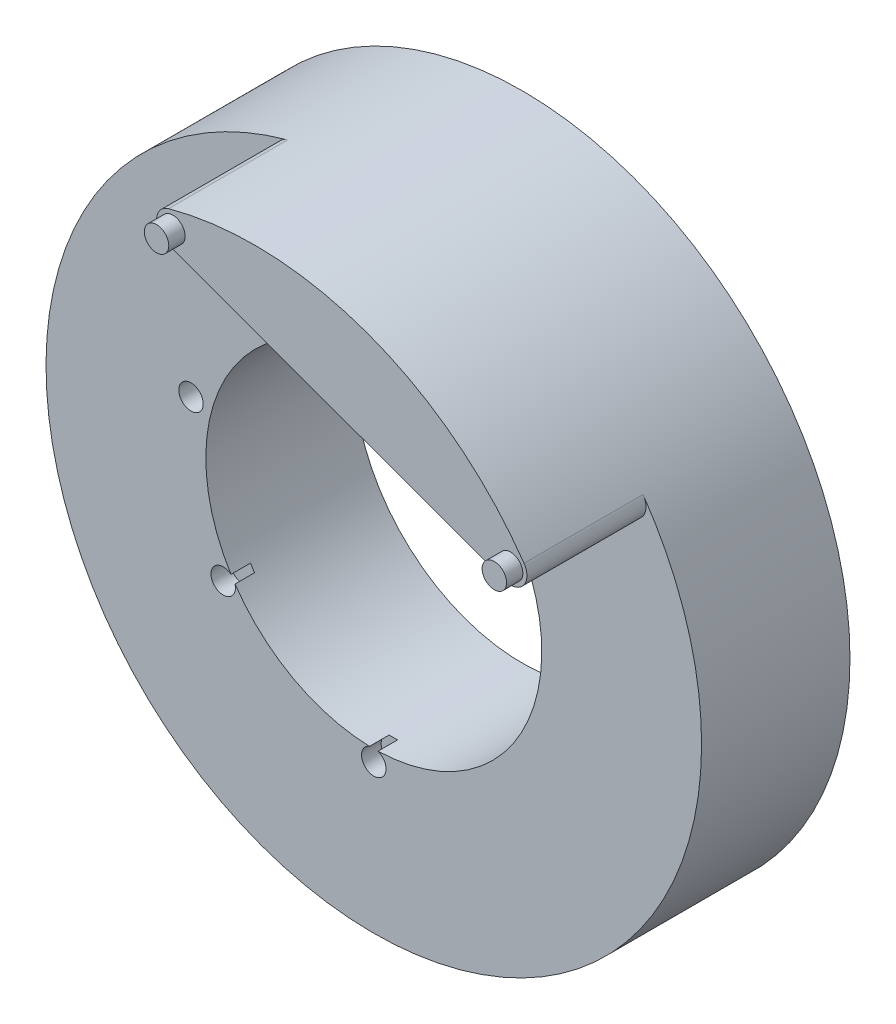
ISO-10303-21;
HEADER;
FILE_DESCRIPTION(('STEP AP214'),'2;1');
FILE_NAME('part.step','',(''),(''),'','','');
FILE_SCHEMA(('AUTOMOTIVE_DESIGN { 1 0 10303 214 1 1 1 1 }'));
ENDSEC;
DATA;
#1=APPLICATION_CONTEXT('core data for automotive mechanical design processes');
#2=APPLICATION_PROTOCOL_DEFINITION('international standard','automotive_design',2000,#1);
#3=PRODUCT_CONTEXT('',#1,'mechanical');
#4=PRODUCT('Part','Part','',(#3));
#5=PRODUCT_RELATED_PRODUCT_CATEGORY('part','',(#4));
#6=PRODUCT_DEFINITION_FORMATION('','',#4);
#7=PRODUCT_DEFINITION_CONTEXT('part definition',#1,'design');
#8=PRODUCT_DEFINITION('design','',#6,#7);
#9=PRODUCT_DEFINITION_SHAPE('','',#8);
#10=(LENGTH_UNIT() NAMED_UNIT(*) SI_UNIT(.MILLI.,.METRE.));
#11=(NAMED_UNIT(*) PLANE_ANGLE_UNIT() SI_UNIT($,.RADIAN.));
#12=(NAMED_UNIT(*) SI_UNIT($,.STERADIAN.) SOLID_ANGLE_UNIT());
#13=UNCERTAINTY_MEASURE_WITH_UNIT(LENGTH_MEASURE(1.E-05),#10,'distance_accuracy_value','');
#14=(GEOMETRIC_REPRESENTATION_CONTEXT(3) GLOBAL_UNCERTAINTY_ASSIGNED_CONTEXT((#13)) GLOBAL_UNIT_ASSIGNED_CONTEXT((#10,
#11,#12)) REPRESENTATION_CONTEXT('',''));
#15=CARTESIAN_POINT('',(0.,0.,0.));
#16=DIRECTION('',(0.,0.,1.));
#17=DIRECTION('',(1.,0.,0.));
#18=AXIS2_PLACEMENT_3D('',#15,#16,#17);
#19=CARTESIAN_POINT('',(4.36835391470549E-13,11.,66.7513852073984));
#20=DIRECTION('',(0.,0.,-1.));
#21=DIRECTION('',(-1.,0.,0.));
#22=AXIS2_PLACEMENT_3D('',#19,#20,#21);
#23=CYLINDRICAL_SURFACE('',#22,20.1);
#24=CARTESIAN_POINT('',(4.36835391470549E-13,11.,0.));
#25=DIRECTION('',(0.,0.,1.));
#26=DIRECTION('',(1.,0.,0.));
#27=AXIS2_PLACEMENT_3D('',#24,#25,#26);
#28=CIRCLE('',#27,20.1);
#29=CARTESIAN_POINT('',(20.1000000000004,11.,0.));
#30=VERTEX_POINT('',#29);
#31=EDGE_CURVE('E145',#30,#30,#28,.T.);
#32=ORIENTED_EDGE('',*,*,#31,.T.);
#33=EDGE_LOOP('',(#32));
#34=FACE_BOUND('',#33,.T.);
#35=CARTESIAN_POINT('',(4.36835391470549E-13,11.,16.4));
#36=DIRECTION('',(0.,0.,1.));
#37=DIRECTION('',(1.,0.,0.));
#38=AXIS2_PLACEMENT_3D('',#35,#36,#37);
#39=CIRCLE('',#38,20.1);
#40=CARTESIAN_POINT('',(16.5128721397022,22.4601506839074,16.4));
#41=VERTEX_POINT('',#40);
#42=CARTESIAN_POINT('',(-5.28315107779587,30.3932543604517,16.4));
#43=VERTEX_POINT('',#42);
#44=EDGE_CURVE('E144',#41,#43,#39,.T.);
#45=ORIENTED_EDGE('',*,*,#44,.F.);
#46=DIRECTION('',(0.,0.,-1.));
#47=VECTOR('',#46,1.);
#48=CARTESIAN_POINT('',(16.5128721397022,22.4601506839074,66.7513852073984));
#49=LINE('',#48,#47);
#50=CARTESIAN_POINT('',(16.5128721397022,22.4601506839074,9.1));
#51=VERTEX_POINT('',#50);
#52=EDGE_CURVE('E135',#41,#51,#49,.T.);
#53=ORIENTED_EDGE('',*,*,#52,.T.);
#54=CARTESIAN_POINT('',(4.36835391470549E-13,11.,9.1));
#55=DIRECTION('',(0.,0.,1.));
#56=DIRECTION('',(1.,0.,0.));
#57=AXIS2_PLACEMENT_3D('',#54,#55,#56);
#58=CIRCLE('',#57,20.1);
#59=CARTESIAN_POINT('',(-5.28315107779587,30.3932543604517,9.1));
#60=VERTEX_POINT('',#59);
#61=EDGE_CURVE('E140',#60,#51,#58,.T.);
#62=ORIENTED_EDGE('',*,*,#61,.F.);
#63=DIRECTION('',(0.,0.,-1.));
#64=VECTOR('',#63,1.);
#65=CARTESIAN_POINT('',(-5.28315107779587,30.3932543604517,66.7513852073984));
#66=LINE('',#65,#64);
#67=EDGE_CURVE('E138',#60,#43,#66,.F.);
#68=ORIENTED_EDGE('',*,*,#67,.T.);
#69=EDGE_LOOP('',(#45,#53,#62,#68));
#70=FACE_BOUND('',#69,.T.);
#71=ADVANCED_FACE('F34',(#34,#70),#23,.T.);
#72=CARTESIAN_POINT('',(4.36835391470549E-13,11.,0.));
#73=DIRECTION('',(0.,0.,1.));
#74=DIRECTION('',(1.,0.,0.));
#75=AXIS2_PLACEMENT_3D('',#72,#73,#74);
#76=PLANE('',#75);
#77=ORIENTED_EDGE('',*,*,#31,.F.);
#78=EDGE_LOOP('',(#77));
#79=FACE_BOUND('',#78,.T.);
#80=CARTESIAN_POINT('',(4.36835391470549E-13,11.,0.));
#81=DIRECTION('',(0.,0.,1.));
#82=DIRECTION('',(1.,0.,0.));
#83=AXIS2_PLACEMENT_3D('',#80,#81,#82);
#84=CIRCLE('',#83,10.2999999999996);
#85=CARTESIAN_POINT('',(10.3,11.,0.));
#86=VERTEX_POINT('',#85);
#87=EDGE_CURVE('E148',#86,#86,#84,.T.);
#88=ORIENTED_EDGE('',*,*,#87,.T.);
#89=EDGE_LOOP('',(#88));
#90=FACE_BOUND('',#89,.T.);
#91=ADVANCED_FACE('F227',(#79,#90),#76,.F.);
#92=CARTESIAN_POINT('',(4.36835391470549E-13,11.,66.7513852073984));
#93=DIRECTION('',(0.,0.,-1.));
#94=DIRECTION('',(-1.,0.,0.));
#95=AXIS2_PLACEMENT_3D('',#92,#93,#94);
#96=CYLINDRICAL_SURFACE('',#95,10.2999999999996);
#97=DIRECTION('',(0.,0.,1.));
#98=VECTOR('',#97,1.);
#99=CARTESIAN_POINT('',(-8.75968956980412,5.58171257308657,8.5));
#100=LINE('',#99,#98);
#101=CARTESIAN_POINT('',(-8.7596895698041,5.58171257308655,7.9));
#102=VERTEX_POINT('',#101);
#103=CARTESIAN_POINT('',(-8.75968956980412,5.58171257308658,9.1));
#104=VERTEX_POINT('',#103);
#105=EDGE_CURVE('E57',#102,#104,#100,.T.);
#106=ORIENTED_EDGE('',*,*,#105,.F.);
#107=CARTESIAN_POINT('',(4.36835391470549E-13,11.,7.9));
#108=DIRECTION('',(0.,0.,1.));
#109=DIRECTION('',(1.,0.,0.));
#110=AXIS2_PLACEMENT_3D('',#107,#108,#109);
#111=CIRCLE('',#110,10.2999999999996);
#112=CARTESIAN_POINT('',(-8.50923966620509,5.19630804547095,7.9));
#113=VERTEX_POINT('',#112);
#114=EDGE_CURVE('E12',#102,#113,#111,.T.);
#115=ORIENTED_EDGE('',*,*,#114,.T.);
#116=DIRECTION('',(0.,0.,1.));
#117=VECTOR('',#116,1.);
#118=CARTESIAN_POINT('',(-8.50923966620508,5.19630804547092,8.5));
#119=LINE('',#118,#117);
#120=CARTESIAN_POINT('',(-8.50923966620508,5.19630804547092,9.1));
#121=VERTEX_POINT('',#120);
#122=EDGE_CURVE('E173',#121,#113,#119,.F.);
#123=ORIENTED_EDGE('',*,*,#122,.F.);
#124=CARTESIAN_POINT('',(4.36835391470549E-13,11.,9.1));
#125=DIRECTION('',(0.,0.,1.));
#126=DIRECTION('',(1.,0.,0.));
#127=AXIS2_PLACEMENT_3D('',#124,#125,#126);
#128=CIRCLE('',#127,10.2999999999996);
#129=CARTESIAN_POINT('',(-0.260529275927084,0.703295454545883,9.1));
#130=VERTEX_POINT('',#129);
#131=EDGE_CURVE('E143',#121,#130,#128,.T.);
#132=ORIENTED_EDGE('',*,*,#131,.T.);
#133=DIRECTION('',(0.,0.,1.));
#134=VECTOR('',#133,1.);
#135=CARTESIAN_POINT('',(-0.260529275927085,0.703295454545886,8.5));
#136=LINE('',#135,#134);
#137=CARTESIAN_POINT('',(-0.260529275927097,0.703295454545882,7.9));
#138=VERTEX_POINT('',#137);
#139=EDGE_CURVE('E49',#138,#130,#136,.T.);
#140=ORIENTED_EDGE('',*,*,#139,.F.);
#141=CARTESIAN_POINT('',(4.36835391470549E-13,11.,7.9));
#142=DIRECTION('',(0.,0.,1.));
#143=DIRECTION('',(1.,0.,0.));
#144=AXIS2_PLACEMENT_3D('',#141,#142,#143);
#145=CIRCLE('',#144,10.2999999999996);
#146=CARTESIAN_POINT('',(0.260529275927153,0.703295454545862,7.9));
#147=VERTEX_POINT('',#146);
#148=EDGE_CURVE('E42',#138,#147,#145,.T.);
#149=ORIENTED_EDGE('',*,*,#148,.T.);
#150=DIRECTION('',(0.,0.,1.));
#151=VECTOR('',#150,1.);
#152=CARTESIAN_POINT('',(0.260529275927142,0.703295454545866,8.5));
#153=LINE('',#152,#151);
#154=CARTESIAN_POINT('',(0.260529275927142,0.703295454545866,9.1));
#155=VERTEX_POINT('',#154);
#156=EDGE_CURVE('E99',#155,#147,#153,.F.);
#157=ORIENTED_EDGE('',*,*,#156,.F.);
#158=EDGE_CURVE('E141',#155,#104,#128,.T.);
#159=ORIENTED_EDGE('',*,*,#158,.T.);
#160=EDGE_LOOP('',(#106,#115,#123,#132,#140,#149,#157,#159));
#161=FACE_BOUND('',#160,.T.);
#162=ORIENTED_EDGE('',*,*,#87,.F.);
#163=EDGE_LOOP('',(#162));
#164=FACE_BOUND('',#163,.T.);
#165=ADVANCED_FACE('F114',(#161,#164),#96,.F.);
#166=CARTESIAN_POINT('',(-11.20763062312,13.7807288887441,9.1));
#167=DIRECTION('',(0.,0.,1.));
#168=DIRECTION('',(-0.25887126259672,-0.965911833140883,0.));
#169=AXIS2_PLACEMENT_3D('',#166,#167,#168);
#170=PLANE('',#169);
#171=CARTESIAN_POINT('',(-11.20763062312,13.7807288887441,9.1));
#172=DIRECTION('',(0.,0.,1.));
#173=DIRECTION('',(1.,0.,0.));
#174=AXIS2_PLACEMENT_3D('',#171,#172,#173);
#175=CIRCLE('',#174,0.75);
#176=CARTESIAN_POINT('',(-10.45763062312,13.7807288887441,9.1));
#177=VERTEX_POINT('',#176);
#178=EDGE_CURVE('E178',#177,#177,#175,.T.);
#179=ORIENTED_EDGE('',*,*,#178,.F.);
#180=EDGE_LOOP('',(#179));
#181=FACE_BOUND('',#180,.T.);
#182=CARTESIAN_POINT('',(-9.23309265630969,5.,9.1));
#183=DIRECTION('',(0.,0.,1.));
#184=DIRECTION('',(1.,0.,0.));
#185=AXIS2_PLACEMENT_3D('',#182,#183,#184);
#186=CIRCLE('',#185,0.75);
#187=EDGE_CURVE('E117',#104,#121,#186,.T.);
#188=ORIENTED_EDGE('',*,*,#187,.F.);
#189=ORIENTED_EDGE('',*,*,#158,.F.);
#190=CARTESIAN_POINT('',(0.,0.,9.1));
#191=DIRECTION('',(0.,0.,1.));
#192=DIRECTION('',(1.,0.,0.));
#193=AXIS2_PLACEMENT_3D('',#190,#191,#192);
#194=CIRCLE('',#193,0.75);
#195=EDGE_CURVE('E103',#130,#155,#194,.T.);
#196=ORIENTED_EDGE('',*,*,#195,.F.);
#197=ORIENTED_EDGE('',*,*,#131,.F.);
#198=EDGE_LOOP('',(#188,#189,#196,#197));
#199=FACE_BOUND('',#198,.T.);
#200=DIRECTION('',(0.939692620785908,-0.342020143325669,0.));
#201=VECTOR('',#200,1.);
#202=CARTESIAN_POINT('',(-7.98821577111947,29.4444682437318,9.1));
#203=LINE('',#202,#201);
#204=CARTESIAN_POINT('',(-5.36232788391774,28.4887232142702,9.1));
#205=VERTEX_POINT('',#204);
#206=CARTESIAN_POINT('',(15.3493160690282,20.9503013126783,9.1));
#207=VERTEX_POINT('',#206);
#208=EDGE_CURVE('E155',#205,#207,#203,.T.);
#209=ORIENTED_EDGE('',*,*,#208,.F.);
#210=CARTESIAN_POINT('',(-5.02030774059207,29.4284158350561,9.1));
#211=DIRECTION('',(0.,0.,1.));
#212=DIRECTION('',(1.,0.,0.));
#213=AXIS2_PLACEMENT_3D('',#210,#211,#212);
#214=CIRCLE('',#213,1.);
#215=EDGE_CURVE('E121',#205,#60,#214,.F.);
#216=ORIENTED_EDGE('',*,*,#215,.T.);
#217=ORIENTED_EDGE('',*,*,#61,.T.);
#218=CARTESIAN_POINT('',(15.6913362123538,21.8899939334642,9.1));
#219=DIRECTION('',(0.,0.,1.));
#220=DIRECTION('',(1.,0.,0.));
#221=AXIS2_PLACEMENT_3D('',#218,#219,#220);
#222=CIRCLE('',#221,1.);
#223=EDGE_CURVE('E124',#51,#207,#222,.F.);
#224=ORIENTED_EDGE('',*,*,#223,.T.);
#225=EDGE_LOOP('',(#209,#216,#217,#224));
#226=FACE_BOUND('',#225,.T.);
#227=ADVANCED_FACE('F193',(#181,#199,#226),#170,.T.);
#228=CARTESIAN_POINT('',(-7.98821577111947,29.4444682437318,46.4388038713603));
#229=DIRECTION('',(0.342020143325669,0.939692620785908,0.));
#230=DIRECTION('',(-0.939692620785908,0.342020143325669,0.));
#231=AXIS2_PLACEMENT_3D('',#228,#229,#230);
#232=PLANE('',#231);
#233=ORIENTED_EDGE('',*,*,#208,.T.);
#234=DIRECTION('',(0.,0.,-1.));
#235=VECTOR('',#234,1.);
#236=CARTESIAN_POINT('',(15.3493160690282,20.9503013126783,46.4388038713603));
#237=LINE('',#236,#235);
#238=CARTESIAN_POINT('',(15.3493160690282,20.9503013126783,16.4));
#239=VERTEX_POINT('',#238);
#240=EDGE_CURVE('E130',#207,#239,#237,.F.);
#241=ORIENTED_EDGE('',*,*,#240,.T.);
#242=DIRECTION('',(0.939692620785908,-0.342020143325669,0.));
#243=VECTOR('',#242,1.);
#244=CARTESIAN_POINT('',(-7.98821577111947,29.4444682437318,16.4));
#245=LINE('',#244,#243);
#246=CARTESIAN_POINT('',(-5.36232788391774,28.4887232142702,16.4));
#247=VERTEX_POINT('',#246);
#248=EDGE_CURVE('E152',#247,#239,#245,.T.);
#249=ORIENTED_EDGE('',*,*,#248,.F.);
#250=DIRECTION('',(0.,0.,-1.));
#251=VECTOR('',#250,1.);
#252=CARTESIAN_POINT('',(-5.36232788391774,28.4887232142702,46.4388038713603));
#253=LINE('',#252,#251);
#254=EDGE_CURVE('E132',#247,#205,#253,.T.);
#255=ORIENTED_EDGE('',*,*,#254,.T.);
#256=EDGE_LOOP('',(#233,#241,#249,#255));
#257=FACE_BOUND('',#256,.T.);
#258=ADVANCED_FACE('F196',(#257),#232,.F.);
#259=CARTESIAN_POINT('',(4.36835391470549E-13,11.,16.4));
#260=DIRECTION('',(0.,0.,1.));
#261=DIRECTION('',(1.,0.,0.));
#262=AXIS2_PLACEMENT_3D('',#259,#260,#261);
#263=PLANE('',#262);
#264=CARTESIAN_POINT('',(-5.02030774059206,29.4284158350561,16.4));
#265=DIRECTION('',(0.,0.,1.));
#266=DIRECTION('',(1.,0.,0.));
#267=AXIS2_PLACEMENT_3D('',#264,#265,#266);
#268=CIRCLE('',#267,0.75);
#269=CARTESIAN_POINT('',(-4.27030774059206,29.4284158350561,16.4));
#270=VERTEX_POINT('',#269);
#271=EDGE_CURVE('E169',#270,#270,#268,.T.);
#272=ORIENTED_EDGE('',*,*,#271,.F.);
#273=EDGE_LOOP('',(#272));
#274=FACE_BOUND('',#273,.T.);
#275=CARTESIAN_POINT('',(15.6913362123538,21.8899939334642,16.4));
#276=DIRECTION('',(0.,0.,1.));
#277=DIRECTION('',(1.,0.,0.));
#278=AXIS2_PLACEMENT_3D('',#275,#276,#277);
#279=CIRCLE('',#278,0.750000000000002);
#280=CARTESIAN_POINT('',(16.4413362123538,21.8899939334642,16.4));
#281=VERTEX_POINT('',#280);
#282=EDGE_CURVE('E163',#281,#281,#279,.T.);
#283=ORIENTED_EDGE('',*,*,#282,.F.);
#284=EDGE_LOOP('',(#283));
#285=FACE_BOUND('',#284,.T.);
#286=ORIENTED_EDGE('',*,*,#248,.T.);
#287=CARTESIAN_POINT('',(15.6913362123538,21.8899939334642,16.4));
#288=DIRECTION('',(0.,0.,1.));
#289=DIRECTION('',(1.,0.,0.));
#290=AXIS2_PLACEMENT_3D('',#287,#288,#289);
#291=CIRCLE('',#290,1.);
#292=EDGE_CURVE('E126',#239,#41,#291,.T.);
#293=ORIENTED_EDGE('',*,*,#292,.T.);
#294=ORIENTED_EDGE('',*,*,#44,.T.);
#295=CARTESIAN_POINT('',(-5.02030774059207,29.4284158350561,16.4));
#296=DIRECTION('',(0.,0.,1.));
#297=DIRECTION('',(1.,0.,0.));
#298=AXIS2_PLACEMENT_3D('',#295,#296,#297);
#299=CIRCLE('',#298,1.);
#300=EDGE_CURVE('E128',#43,#247,#299,.T.);
#301=ORIENTED_EDGE('',*,*,#300,.T.);
#302=EDGE_LOOP('',(#286,#293,#294,#301));
#303=FACE_BOUND('',#302,.T.);
#304=ADVANCED_FACE('F213',(#274,#285,#303),#263,.T.);
#305=CARTESIAN_POINT('',(15.6913362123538,21.8899939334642,66.7513852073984));
#306=DIRECTION('',(0.,0.,-1.));
#307=DIRECTION('',(-1.,0.,0.));
#308=AXIS2_PLACEMENT_3D('',#305,#306,#307);
#309=CYLINDRICAL_SURFACE('',#308,1.);
#310=ORIENTED_EDGE('',*,*,#292,.F.);
#311=ORIENTED_EDGE('',*,*,#240,.F.);
#312=ORIENTED_EDGE('',*,*,#223,.F.);
#313=ORIENTED_EDGE('',*,*,#52,.F.);
#314=EDGE_LOOP('',(#310,#311,#312,#313));
#315=FACE_BOUND('',#314,.T.);
#316=ADVANCED_FACE('F209',(#315),#309,.T.);
#317=CARTESIAN_POINT('',(-5.02030774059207,29.4284158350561,66.7513852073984));
#318=DIRECTION('',(0.,0.,-1.));
#319=DIRECTION('',(-1.,0.,0.));
#320=AXIS2_PLACEMENT_3D('',#317,#318,#319);
#321=CYLINDRICAL_SURFACE('',#320,1.);
#322=ORIENTED_EDGE('',*,*,#300,.F.);
#323=ORIENTED_EDGE('',*,*,#67,.F.);
#324=ORIENTED_EDGE('',*,*,#215,.F.);
#325=ORIENTED_EDGE('',*,*,#254,.F.);
#326=EDGE_LOOP('',(#322,#323,#324,#325));
#327=FACE_BOUND('',#326,.T.);
#328=ADVANCED_FACE('F36',(#327),#321,.T.);
#329=CARTESIAN_POINT('',(15.6913362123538,21.8899939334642,20.3213203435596));
#330=DIRECTION('',(0.,0.,-1.));
#331=DIRECTION('',(-1.,0.,0.));
#332=AXIS2_PLACEMENT_3D('',#329,#330,#331);
#333=CYLINDRICAL_SURFACE('',#332,0.750000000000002);
#334=ORIENTED_EDGE('',*,*,#282,.T.);
#335=EDGE_LOOP('',(#334));
#336=FACE_BOUND('',#335,.T.);
#337=CARTESIAN_POINT('',(15.6913362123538,21.8899939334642,17.4));
#338=DIRECTION('',(0.,0.,1.));
#339=DIRECTION('',(1.,0.,0.));
#340=AXIS2_PLACEMENT_3D('',#337,#338,#339);
#341=CIRCLE('',#340,0.750000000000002);
#342=CARTESIAN_POINT('',(16.4413362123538,21.8899939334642,17.4));
#343=VERTEX_POINT('',#342);
#344=EDGE_CURVE('E160',#343,#343,#341,.T.);
#345=ORIENTED_EDGE('',*,*,#344,.F.);
#346=EDGE_LOOP('',(#345));
#347=FACE_BOUND('',#346,.T.);
#348=ADVANCED_FACE('F218',(#336,#347),#333,.T.);
#349=CARTESIAN_POINT('',(4.36835391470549E-13,11.,17.4));
#350=DIRECTION('',(0.,0.,1.));
#351=DIRECTION('',(1.,0.,0.));
#352=AXIS2_PLACEMENT_3D('',#349,#350,#351);
#353=PLANE('',#352);
#354=ORIENTED_EDGE('',*,*,#344,.T.);
#355=EDGE_LOOP('',(#354));
#356=FACE_BOUND('',#355,.T.);
#357=ADVANCED_FACE('F223',(#356),#353,.T.);
#358=CARTESIAN_POINT('',(-5.02030774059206,29.4284158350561,20.3213203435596));
#359=DIRECTION('',(0.,0.,-1.));
#360=DIRECTION('',(-1.,0.,0.));
#361=AXIS2_PLACEMENT_3D('',#358,#359,#360);
#362=CYLINDRICAL_SURFACE('',#361,0.75);
#363=ORIENTED_EDGE('',*,*,#271,.T.);
#364=EDGE_LOOP('',(#363));
#365=FACE_BOUND('',#364,.T.);
#366=CARTESIAN_POINT('',(-5.02030774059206,29.4284158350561,17.4));
#367=DIRECTION('',(0.,0.,1.));
#368=DIRECTION('',(1.,0.,0.));
#369=AXIS2_PLACEMENT_3D('',#366,#367,#368);
#370=CIRCLE('',#369,0.75);
#371=CARTESIAN_POINT('',(-4.27030774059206,29.4284158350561,17.4));
#372=VERTEX_POINT('',#371);
#373=EDGE_CURVE('E166',#372,#372,#370,.T.);
#374=ORIENTED_EDGE('',*,*,#373,.F.);
#375=EDGE_LOOP('',(#374));
#376=FACE_BOUND('',#375,.T.);
#377=ADVANCED_FACE('F244',(#365,#376),#362,.T.);
#378=CARTESIAN_POINT('',(4.36835391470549E-13,11.,17.4));
#379=DIRECTION('',(0.,0.,1.));
#380=DIRECTION('',(1.,0.,0.));
#381=AXIS2_PLACEMENT_3D('',#378,#379,#380);
#382=PLANE('',#381);
#383=ORIENTED_EDGE('',*,*,#373,.T.);
#384=EDGE_LOOP('',(#383));
#385=FACE_BOUND('',#384,.T.);
#386=ADVANCED_FACE('F247',(#385),#382,.T.);
#387=CARTESIAN_POINT('',(0.,0.,7.9));
#388=DIRECTION('',(0.,0.,1.));
#389=DIRECTION('',(1.,0.,0.));
#390=AXIS2_PLACEMENT_3D('',#387,#388,#389);
#391=CYLINDRICAL_SURFACE('',#390,0.75);
#392=ORIENTED_EDGE('',*,*,#139,.T.);
#393=ORIENTED_EDGE('',*,*,#195,.T.);
#394=ORIENTED_EDGE('',*,*,#156,.T.);
#395=CARTESIAN_POINT('',(0.,0.,7.9));
#396=DIRECTION('',(0.,0.,1.));
#397=DIRECTION('',(1.,0.,0.));
#398=AXIS2_PLACEMENT_3D('',#395,#396,#397);
#399=CIRCLE('',#398,0.75);
#400=EDGE_CURVE('E102',#138,#147,#399,.T.);
#401=ORIENTED_EDGE('',*,*,#400,.F.);
#402=EDGE_LOOP('',(#392,#393,#394,#401));
#403=FACE_BOUND('',#402,.T.);
#404=ADVANCED_FACE('F101',(#403),#391,.F.);
#405=CARTESIAN_POINT('',(0.,0.,7.9));
#406=DIRECTION('',(0.,0.,1.));
#407=DIRECTION('',(1.,0.,0.));
#408=AXIS2_PLACEMENT_3D('',#405,#406,#407);
#409=PLANE('',#408);
#410=ORIENTED_EDGE('',*,*,#400,.T.);
#411=ORIENTED_EDGE('',*,*,#148,.F.);
#412=EDGE_LOOP('',(#410,#411));
#413=FACE_BOUND('',#412,.T.);
#414=ADVANCED_FACE('F111',(#413),#409,.T.);
#415=CARTESIAN_POINT('',(-9.23309265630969,5.,7.9));
#416=DIRECTION('',(0.,0.,1.));
#417=DIRECTION('',(1.,0.,0.));
#418=AXIS2_PLACEMENT_3D('',#415,#416,#417);
#419=CYLINDRICAL_SURFACE('',#418,0.75);
#420=ORIENTED_EDGE('',*,*,#105,.T.);
#421=ORIENTED_EDGE('',*,*,#187,.T.);
#422=ORIENTED_EDGE('',*,*,#122,.T.);
#423=CARTESIAN_POINT('',(-9.23309265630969,5.,7.9));
#424=DIRECTION('',(0.,0.,1.));
#425=DIRECTION('',(1.,0.,0.));
#426=AXIS2_PLACEMENT_3D('',#423,#424,#425);
#427=CIRCLE('',#426,0.75);
#428=EDGE_CURVE('E112',#102,#113,#427,.T.);
#429=ORIENTED_EDGE('',*,*,#428,.F.);
#430=EDGE_LOOP('',(#420,#421,#422,#429));
#431=FACE_BOUND('',#430,.T.);
#432=ADVANCED_FACE('F258',(#431),#419,.F.);
#433=CARTESIAN_POINT('',(-9.23309265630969,5.,7.9));
#434=DIRECTION('',(0.,0.,1.));
#435=DIRECTION('',(1.,0.,0.));
#436=AXIS2_PLACEMENT_3D('',#433,#434,#435);
#437=PLANE('',#436);
#438=ORIENTED_EDGE('',*,*,#428,.T.);
#439=ORIENTED_EDGE('',*,*,#114,.F.);
#440=EDGE_LOOP('',(#438,#439));
#441=FACE_BOUND('',#440,.T.);
#442=ADVANCED_FACE('F189',(#441),#437,.T.);
#443=CARTESIAN_POINT('',(-11.20763062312,13.7807288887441,7.9));
#444=DIRECTION('',(0.,0.,1.));
#445=DIRECTION('',(1.,0.,0.));
#446=AXIS2_PLACEMENT_3D('',#443,#444,#445);
#447=CYLINDRICAL_SURFACE('',#446,0.75);
#448=CARTESIAN_POINT('',(-11.20763062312,13.7807288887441,7.9));
#449=DIRECTION('',(0.,0.,1.));
#450=DIRECTION('',(1.,0.,0.));
#451=AXIS2_PLACEMENT_3D('',#448,#449,#450);
#452=CIRCLE('',#451,0.75);
#453=CARTESIAN_POINT('',(-10.45763062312,13.7807288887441,7.9));
#454=VERTEX_POINT('',#453);
#455=EDGE_CURVE('E108',#454,#454,#452,.T.);
#456=ORIENTED_EDGE('',*,*,#455,.F.);
#457=EDGE_LOOP('',(#456));
#458=FACE_BOUND('',#457,.T.);
#459=ORIENTED_EDGE('',*,*,#178,.T.);
#460=EDGE_LOOP('',(#459));
#461=FACE_BOUND('',#460,.T.);
#462=ADVANCED_FACE('F186',(#458,#461),#447,.F.);
#463=CARTESIAN_POINT('',(-11.20763062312,13.7807288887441,7.9));
#464=DIRECTION('',(0.,0.,1.));
#465=DIRECTION('',(1.,0.,0.));
#466=AXIS2_PLACEMENT_3D('',#463,#464,#465);
#467=PLANE('',#466);
#468=ORIENTED_EDGE('',*,*,#455,.T.);
#469=EDGE_LOOP('',(#468));
#470=FACE_BOUND('',#469,.T.);
#471=ADVANCED_FACE('F184',(#470),#467,.T.);
#472=CLOSED_SHELL('',(#71,#91,#165,#227,#258,#304,#316,#328,#348,#357,#377,#386,#404,#414,#432,
#442,#462,#471));
#473=MANIFOLD_SOLID_BREP('B2',#472);
#474=ADVANCED_BREP_SHAPE_REPRESENTATION('',(#18,#473),#14);
#475=SHAPE_DEFINITION_REPRESENTATION(#9,#474);
ENDSEC;
END-ISO-10303-21;
